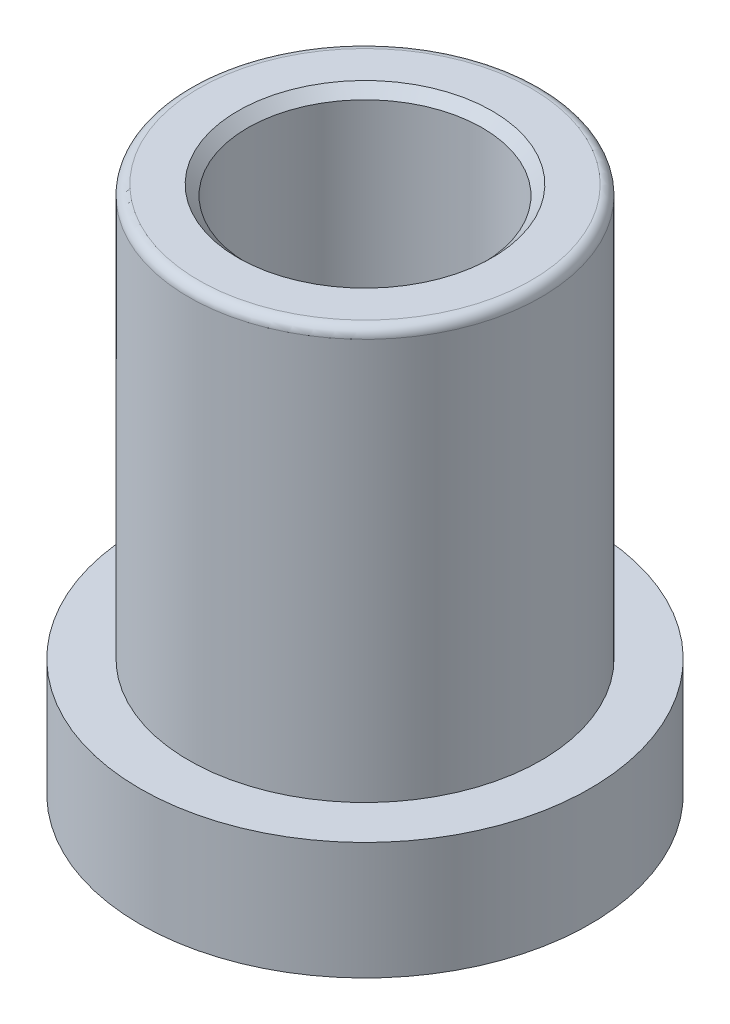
ISO-10303-21;
HEADER;
FILE_DESCRIPTION(('STEP AP214'),'2;1');
FILE_NAME('part.step','',(''),(''),'','','');
FILE_SCHEMA(('AUTOMOTIVE_DESIGN { 1 0 10303 214 1 1 1 1 }'));
ENDSEC;
DATA;
#1=APPLICATION_CONTEXT('core data for automotive mechanical design processes');
#2=APPLICATION_PROTOCOL_DEFINITION('international standard','automotive_design',2000,#1);
#3=PRODUCT_CONTEXT('',#1,'mechanical');
#4=PRODUCT('Part','Part','',(#3));
#5=PRODUCT_RELATED_PRODUCT_CATEGORY('part','',(#4));
#6=PRODUCT_DEFINITION_FORMATION('','',#4);
#7=PRODUCT_DEFINITION_CONTEXT('part definition',#1,'design');
#8=PRODUCT_DEFINITION('design','',#6,#7);
#9=PRODUCT_DEFINITION_SHAPE('','',#8);
#10=(LENGTH_UNIT() NAMED_UNIT(*) SI_UNIT(.MILLI.,.METRE.));
#11=(NAMED_UNIT(*) PLANE_ANGLE_UNIT() SI_UNIT($,.RADIAN.));
#12=(NAMED_UNIT(*) SI_UNIT($,.STERADIAN.) SOLID_ANGLE_UNIT());
#13=UNCERTAINTY_MEASURE_WITH_UNIT(LENGTH_MEASURE(1.E-05),#10,'distance_accuracy_value','');
#14=(GEOMETRIC_REPRESENTATION_CONTEXT(3) GLOBAL_UNCERTAINTY_ASSIGNED_CONTEXT((#13)) GLOBAL_UNIT_ASSIGNED_CONTEXT((#10,
#11,#12)) REPRESENTATION_CONTEXT('',''));
#15=CARTESIAN_POINT('',(0.,0.,0.));
#16=DIRECTION('',(0.,0.,1.));
#17=DIRECTION('',(1.,0.,0.));
#18=AXIS2_PLACEMENT_3D('',#15,#16,#17);
#19=CARTESIAN_POINT('',(0.,0.,0.));
#20=DIRECTION('',(0.,-1.,0.));
#21=DIRECTION('',(0.,0.,-1.));
#22=AXIS2_PLACEMENT_3D('',#19,#20,#21);
#23=CYLINDRICAL_SURFACE('',#22,9.);
#24=CARTESIAN_POINT('',(0.,20.5,0.));
#25=DIRECTION('',(0.,-1.,0.));
#26=DIRECTION('',(0.,0.,-1.));
#27=AXIS2_PLACEMENT_3D('',#24,#25,#26);
#28=CIRCLE('',#27,9.);
#29=CARTESIAN_POINT('',(0.,20.5,-9.));
#30=VERTEX_POINT('',#29);
#31=EDGE_CURVE('E20',#30,#30,#28,.T.);
#32=ORIENTED_EDGE('',*,*,#31,.T.);
#33=EDGE_LOOP('',(#32));
#34=FACE_BOUND('',#33,.T.);
#35=CARTESIAN_POINT('',(0.,0.,0.));
#36=DIRECTION('',(0.,-1.,0.));
#37=DIRECTION('',(0.,0.,-1.));
#38=AXIS2_PLACEMENT_3D('',#35,#36,#37);
#39=CIRCLE('',#38,9.);
#40=CARTESIAN_POINT('',(0.,0.,-9.));
#41=VERTEX_POINT('',#40);
#42=EDGE_CURVE('E48',#41,#41,#39,.T.);
#43=ORIENTED_EDGE('',*,*,#42,.F.);
#44=EDGE_LOOP('',(#43));
#45=FACE_BOUND('',#44,.T.);
#46=ADVANCED_FACE('F13',(#34,#45),#23,.T.);
#47=CARTESIAN_POINT('',(-9.,21.,0.));
#48=DIRECTION('',(0.,-1.,0.));
#49=DIRECTION('',(0.,0.,-1.));
#50=AXIS2_PLACEMENT_3D('',#47,#48,#49);
#51=PLANE('',#50);
#52=CARTESIAN_POINT('',(0.,21.,0.));
#53=DIRECTION('',(0.,-1.,0.));
#54=DIRECTION('',(0.,0.,-1.));
#55=AXIS2_PLACEMENT_3D('',#52,#53,#54);
#56=CIRCLE('',#55,8.5);
#57=CARTESIAN_POINT('',(0.,21.,-8.5));
#58=VERTEX_POINT('',#57);
#59=EDGE_CURVE('E8',#58,#58,#56,.F.);
#60=ORIENTED_EDGE('',*,*,#59,.T.);
#61=EDGE_LOOP('',(#60));
#62=FACE_BOUND('',#61,.T.);
#63=CARTESIAN_POINT('',(0.,21.,0.));
#64=DIRECTION('',(0.,-1.,0.));
#65=DIRECTION('',(0.,0.,-1.));
#66=AXIS2_PLACEMENT_3D('',#63,#64,#65);
#67=CIRCLE('',#66,6.5);
#68=CARTESIAN_POINT('',(0.,21.,-6.5));
#69=VERTEX_POINT('',#68);
#70=EDGE_CURVE('E36',#69,#69,#67,.T.);
#71=ORIENTED_EDGE('',*,*,#70,.T.);
#72=EDGE_LOOP('',(#71));
#73=FACE_BOUND('',#72,.T.);
#74=ADVANCED_FACE('F55',(#62,#73),#51,.F.);
#75=CARTESIAN_POINT('',(0.,0.,0.));
#76=DIRECTION('',(0.,-1.,0.));
#77=DIRECTION('',(0.,0.,-1.));
#78=AXIS2_PLACEMENT_3D('',#75,#76,#77);
#79=CYLINDRICAL_SURFACE('',#78,6.);
#80=CARTESIAN_POINT('',(0.,20.5,0.));
#81=DIRECTION('',(0.,-1.,0.));
#82=DIRECTION('',(0.,0.,-1.));
#83=AXIS2_PLACEMENT_3D('',#80,#81,#82);
#84=CIRCLE('',#83,6.);
#85=CARTESIAN_POINT('',(0.,20.5,-6.));
#86=VERTEX_POINT('',#85);
#87=EDGE_CURVE('E33',#86,#86,#84,.F.);
#88=ORIENTED_EDGE('',*,*,#87,.T.);
#89=EDGE_LOOP('',(#88));
#90=FACE_BOUND('',#89,.T.);
#91=CARTESIAN_POINT('',(0.,-6.,0.));
#92=DIRECTION('',(0.,-1.,0.));
#93=DIRECTION('',(0.,0.,-1.));
#94=AXIS2_PLACEMENT_3D('',#91,#92,#93);
#95=CIRCLE('',#94,6.);
#96=CARTESIAN_POINT('',(0.,-6.,-6.));
#97=VERTEX_POINT('',#96);
#98=EDGE_CURVE('E39',#97,#97,#95,.T.);
#99=ORIENTED_EDGE('',*,*,#98,.T.);
#100=EDGE_LOOP('',(#99));
#101=FACE_BOUND('',#100,.T.);
#102=ADVANCED_FACE('F62',(#90,#101),#79,.F.);
#103=CARTESIAN_POINT('',(0.,-6.15,0.));
#104=DIRECTION('',(0.,-1.,0.));
#105=DIRECTION('',(0.,0.,-1.));
#106=AXIS2_PLACEMENT_3D('',#103,#104,#105);
#107=CONICAL_SURFACE('',#106,6.1,0.588002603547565);
#108=CARTESIAN_POINT('',(0.,-6.36,0.));
#109=DIRECTION('',(0.,1.,0.));
#110=DIRECTION('',(0.,0.,1.));
#111=AXIS2_PLACEMENT_3D('',#108,#109,#110);
#112=CIRCLE('',#111,6.24);
#113=CARTESIAN_POINT('',(0.,-6.36,6.24));
#114=VERTEX_POINT('',#113);
#115=EDGE_CURVE('E24',#114,#114,#112,.F.);
#116=ORIENTED_EDGE('',*,*,#115,.T.);
#117=EDGE_LOOP('',(#116));
#118=FACE_BOUND('',#117,.T.);
#119=ORIENTED_EDGE('',*,*,#98,.F.);
#120=EDGE_LOOP('',(#119));
#121=FACE_BOUND('',#120,.T.);
#122=ADVANCED_FACE('F81',(#118,#121),#107,.F.);
#123=CARTESIAN_POINT('',(-6.1,-6.,0.));
#124=DIRECTION('',(0.,1.,0.));
#125=DIRECTION('',(0.,0.,1.));
#126=AXIS2_PLACEMENT_3D('',#123,#124,#125);
#127=PLANE('',#126);
#128=CARTESIAN_POINT('',(0.,-6.,0.));
#129=DIRECTION('',(0.,1.,0.));
#130=DIRECTION('',(0.,0.,1.));
#131=AXIS2_PLACEMENT_3D('',#128,#129,#130);
#132=CIRCLE('',#131,6.6);
#133=CARTESIAN_POINT('',(0.,-6.,6.6));
#134=VERTEX_POINT('',#133);
#135=EDGE_CURVE('E28',#134,#134,#132,.T.);
#136=ORIENTED_EDGE('',*,*,#135,.T.);
#137=EDGE_LOOP('',(#136));
#138=FACE_BOUND('',#137,.T.);
#139=CARTESIAN_POINT('',(0.,-6.,0.));
#140=DIRECTION('',(0.,-1.,0.));
#141=DIRECTION('',(0.,0.,-1.));
#142=AXIS2_PLACEMENT_3D('',#139,#140,#141);
#143=CIRCLE('',#142,11.5);
#144=CARTESIAN_POINT('',(0.,-6.,-11.5));
#145=VERTEX_POINT('',#144);
#146=EDGE_CURVE('E42',#145,#145,#143,.T.);
#147=ORIENTED_EDGE('',*,*,#146,.T.);
#148=EDGE_LOOP('',(#147));
#149=FACE_BOUND('',#148,.T.);
#150=ADVANCED_FACE('F84',(#138,#149),#127,.F.);
#151=CARTESIAN_POINT('',(0.,0.,0.));
#152=DIRECTION('',(0.,-1.,0.));
#153=DIRECTION('',(0.,0.,-1.));
#154=AXIS2_PLACEMENT_3D('',#151,#152,#153);
#155=CYLINDRICAL_SURFACE('',#154,11.5);
#156=ORIENTED_EDGE('',*,*,#146,.F.);
#157=EDGE_LOOP('',(#156));
#158=FACE_BOUND('',#157,.T.);
#159=CARTESIAN_POINT('',(0.,0.,0.));
#160=DIRECTION('',(0.,-1.,0.));
#161=DIRECTION('',(0.,0.,-1.));
#162=AXIS2_PLACEMENT_3D('',#159,#160,#161);
#163=CIRCLE('',#162,11.5);
#164=CARTESIAN_POINT('',(0.,0.,-11.5));
#165=VERTEX_POINT('',#164);
#166=EDGE_CURVE('E45',#165,#165,#163,.T.);
#167=ORIENTED_EDGE('',*,*,#166,.T.);
#168=EDGE_LOOP('',(#167));
#169=FACE_BOUND('',#168,.T.);
#170=ADVANCED_FACE('F96',(#158,#169),#155,.T.);
#171=CARTESIAN_POINT('',(-11.5,0.,0.));
#172=DIRECTION('',(0.,-1.,0.));
#173=DIRECTION('',(0.,0.,-1.));
#174=AXIS2_PLACEMENT_3D('',#171,#172,#173);
#175=PLANE('',#174);
#176=ORIENTED_EDGE('',*,*,#166,.F.);
#177=EDGE_LOOP('',(#176));
#178=FACE_BOUND('',#177,.T.);
#179=ORIENTED_EDGE('',*,*,#42,.T.);
#180=EDGE_LOOP('',(#179));
#181=FACE_BOUND('',#180,.T.);
#182=ADVANCED_FACE('F52',(#178,#181),#175,.F.);
#183=CARTESIAN_POINT('',(0.,21.,0.));
#184=DIRECTION('',(0.,1.,0.));
#185=DIRECTION('',(0.,0.,1.));
#186=AXIS2_PLACEMENT_3D('',#183,#184,#185);
#187=CONICAL_SURFACE('',#186,6.5,0.785398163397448);
#188=ORIENTED_EDGE('',*,*,#87,.F.);
#189=EDGE_LOOP('',(#188));
#190=FACE_BOUND('',#189,.T.);
#191=ORIENTED_EDGE('',*,*,#70,.F.);
#192=EDGE_LOOP('',(#191));
#193=FACE_BOUND('',#192,.T.);
#194=ADVANCED_FACE('F66',(#190,#193),#187,.F.);
#195=CARTESIAN_POINT('',(0.,-6.5,0.));
#196=DIRECTION('',(0.,1.,0.));
#197=DIRECTION('',(0.,0.,1.));
#198=AXIS2_PLACEMENT_3D('',#195,#196,#197);
#199=CONICAL_SURFACE('',#198,6.1,0.785398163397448);
#200=ORIENTED_EDGE('',*,*,#135,.F.);
#201=EDGE_LOOP('',(#200));
#202=FACE_BOUND('',#201,.T.);
#203=ORIENTED_EDGE('',*,*,#115,.F.);
#204=EDGE_LOOP('',(#203));
#205=FACE_BOUND('',#204,.T.);
#206=ADVANCED_FACE('F68',(#202,#205),#199,.T.);
#207=CARTESIAN_POINT('',(0.,20.5,0.));
#208=DIRECTION('',(0.,-1.,0.));
#209=DIRECTION('',(0.,0.,-1.));
#210=AXIS2_PLACEMENT_3D('',#207,#208,#209);
#211=TOROIDAL_SURFACE('',#210,8.5,0.5);
#212=ORIENTED_EDGE('',*,*,#59,.F.);
#213=EDGE_LOOP('',(#212));
#214=FACE_BOUND('',#213,.T.);
#215=ORIENTED_EDGE('',*,*,#31,.F.);
#216=EDGE_LOOP('',(#215));
#217=FACE_BOUND('',#216,.T.);
#218=ADVANCED_FACE('F15',(#214,#217),#211,.T.);
#219=CLOSED_SHELL('',(#46,#74,#102,#122,#150,#170,#182,#194,#206,#218));
#220=MANIFOLD_SOLID_BREP('B1',#219);
#221=ADVANCED_BREP_SHAPE_REPRESENTATION('',(#18,#220),#14);
#222=SHAPE_DEFINITION_REPRESENTATION(#9,#221);
ENDSEC;
END-ISO-10303-21;
